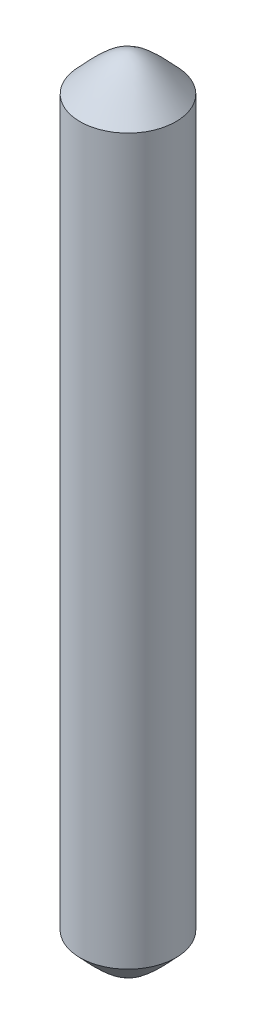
ISO-10303-21;
HEADER;
FILE_DESCRIPTION(('STEP AP214'),'2;1');
FILE_NAME('part.step','',(''),(''),'','','');
FILE_SCHEMA(('AUTOMOTIVE_DESIGN { 1 0 10303 214 1 1 1 1 }'));
ENDSEC;
DATA;
#1=APPLICATION_CONTEXT('core data for automotive mechanical design processes');
#2=APPLICATION_PROTOCOL_DEFINITION('international standard','automotive_design',2000,#1);
#3=PRODUCT_CONTEXT('',#1,'mechanical');
#4=PRODUCT('Part','Part','',(#3));
#5=PRODUCT_RELATED_PRODUCT_CATEGORY('part','',(#4));
#6=PRODUCT_DEFINITION_FORMATION('','',#4);
#7=PRODUCT_DEFINITION_CONTEXT('part definition',#1,'design');
#8=PRODUCT_DEFINITION('design','',#6,#7);
#9=PRODUCT_DEFINITION_SHAPE('','',#8);
#10=(LENGTH_UNIT() NAMED_UNIT(*) SI_UNIT(.MILLI.,.METRE.));
#11=(NAMED_UNIT(*) PLANE_ANGLE_UNIT() SI_UNIT($,.RADIAN.));
#12=(NAMED_UNIT(*) SI_UNIT($,.STERADIAN.) SOLID_ANGLE_UNIT());
#13=UNCERTAINTY_MEASURE_WITH_UNIT(LENGTH_MEASURE(1.E-05),#10,'distance_accuracy_value','');
#14=(GEOMETRIC_REPRESENTATION_CONTEXT(3) GLOBAL_UNCERTAINTY_ASSIGNED_CONTEXT((#13)) GLOBAL_UNIT_ASSIGNED_CONTEXT((#10,
#11,#12)) REPRESENTATION_CONTEXT('',''));
#15=CARTESIAN_POINT('',(0.,0.,0.));
#16=DIRECTION('',(0.,0.,1.));
#17=DIRECTION('',(1.,0.,0.));
#18=AXIS2_PLACEMENT_3D('',#15,#16,#17);
#19=CARTESIAN_POINT('',(0.,40.,0.));
#20=DIRECTION('',(0.,-1.,0.));
#21=DIRECTION('',(0.,0.,-1.));
#22=AXIS2_PLACEMENT_3D('',#19,#20,#21);
#23=CYLINDRICAL_SURFACE('',#22,2.65);
#24=CARTESIAN_POINT('',(2.68644969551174E-13,40.0000932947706,-2.65));
#25=CARTESIAN_POINT('',(-0.148851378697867,40.0000951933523,-2.64999339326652));
#26=CARTESIAN_POINT('',(-0.297810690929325,40.0001534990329,-2.63741634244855));
#27=CARTESIAN_POINT('',(-0.591626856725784,40.0001429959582,-2.5874186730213));
#28=CARTESIAN_POINT('',(-0.736478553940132,40.0000740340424,-2.54996815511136));
#29=CARTESIAN_POINT('',(-1.01778080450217,40.0000395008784,-2.45128909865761));
#30=CARTESIAN_POINT('',(-1.15423531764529,40.0000738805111,-2.39007186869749));
#31=CARTESIAN_POINT('',(-1.41489136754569,40.0001364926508,-2.24561449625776));
#32=CARTESIAN_POINT('',(-1.53909594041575,40.0001647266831,-2.16237982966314));
#33=CARTESIAN_POINT('',(-1.77178520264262,40.0001967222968,-1.97622694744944));
#34=CARTESIAN_POINT('',(-1.88026825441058,40.0002004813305,-1.87330668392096));
#35=CARTESIAN_POINT('',(-2.07841417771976,40.0001879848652,-1.65072983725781));
#36=CARTESIAN_POINT('',(-2.16807631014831,40.0001717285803,-1.53107259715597));
#37=CARTESIAN_POINT('',(-2.32605823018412,40.0001120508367,-1.27833209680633));
#38=CARTESIAN_POINT('',(-2.39437841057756,40.000068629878,-1.1452490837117));
#39=CARTESIAN_POINT('',(-2.47934118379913,40.0000585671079,-0.93858336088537));
#40=CARTESIAN_POINT('',(-2.50474989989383,40.0000644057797,-0.868488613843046));
#41=CARTESIAN_POINT('',(-2.54958212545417,40.0001046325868,-0.726418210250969));
#42=CARTESIAN_POINT('',(-2.56900563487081,40.0001390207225,-0.654442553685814));
#43=CARTESIAN_POINT('',(-2.61804549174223,40.0001872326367,-0.436418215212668));
#44=CARTESIAN_POINT('',(-2.63848198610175,40.0001462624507,-0.288148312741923));
#45=CARTESIAN_POINT('',(-2.65025715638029,40.0001179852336,-0.0649939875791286));
#46=CARTESIAN_POINT('',(-2.65103176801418,40.0001140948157,0.00954892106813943));
#47=CARTESIAN_POINT('',(-2.6463045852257,40.0001273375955,0.158461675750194));
#48=CARTESIAN_POINT('',(-2.64080279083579,40.0001444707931,0.232831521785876));
#49=CARTESIAN_POINT('',(-2.62354961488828,40.0001706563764,0.380840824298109));
#50=CARTESIAN_POINT('',(-2.61179823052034,40.0001797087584,0.454480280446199));
#51=CARTESIAN_POINT('',(-2.5821439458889,40.0001552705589,0.600491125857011));
#52=CARTESIAN_POINT('',(-2.56424104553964,40.0001217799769,0.672862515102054));
#53=CARTESIAN_POINT('',(-2.50146445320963,40.0000565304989,0.887303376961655));
#54=CARTESIAN_POINT('',(-2.4475072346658,40.0000598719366,1.02683260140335));
#55=CARTESIAN_POINT('',(-2.31695908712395,40.0001054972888,1.29477474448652));
#56=CARTESIAN_POINT('',(-2.24036817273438,40.0001477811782,1.4231876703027));
#57=CARTESIAN_POINT('',(-2.06670945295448,40.0001939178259,1.6653528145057));
#58=CARTESIAN_POINT('',(-1.9696416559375,40.0001977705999,1.7791050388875));
#59=CARTESIAN_POINT('',(-1.75778235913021,40.0001935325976,1.98869408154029));
#60=CARTESIAN_POINT('',(-1.64299083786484,40.0001854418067,2.08453087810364));
#61=CARTESIAN_POINT('',(-1.39896865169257,40.0001341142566,2.25557078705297));
#62=CARTESIAN_POINT('',(-1.26973798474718,40.0000908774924,2.33077389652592));
#63=CARTESIAN_POINT('',(-1.0004045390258,40.0000506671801,2.45842780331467));
#64=CARTESIAN_POINT('',(-0.860301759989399,40.0000536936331,2.51087860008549));
#65=CARTESIAN_POINT('',(-0.645197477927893,40.0001114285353,2.5713414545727));
#66=CARTESIAN_POINT('',(-0.572637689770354,40.0001395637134,2.58846373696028));
#67=CARTESIAN_POINT('',(-0.426314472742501,40.0001544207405,2.61654294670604));
#68=CARTESIAN_POINT('',(-0.352551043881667,40.0001411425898,2.62749987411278));
#69=CARTESIAN_POINT('',(-0.204368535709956,40.0001136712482,2.64315858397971));
#70=CARTESIAN_POINT('',(-0.129949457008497,40.0000994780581,2.64786037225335));
#71=CARTESIAN_POINT('',(0.0190215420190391,40.0000905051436,2.65097865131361));
#72=CARTESIAN_POINT('',(0.0935734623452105,40.0000957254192,2.64939514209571));
#73=CARTESIAN_POINT('',(0.24227885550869,40.0001197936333,2.63995294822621));
#74=CARTESIAN_POINT('',(0.316432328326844,40.0001386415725,2.63209426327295));
#75=CARTESIAN_POINT('',(0.463812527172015,40.00015041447,2.61015887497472));
#76=CARTESIAN_POINT('',(0.537039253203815,40.0001433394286,2.59608217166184));
#77=CARTESIAN_POINT('',(0.682051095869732,40.0001079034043,2.56180680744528));
#78=CARTESIAN_POINT('',(0.753836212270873,40.0000795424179,2.54160814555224));
#79=CARTESIAN_POINT('',(0.895432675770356,40.0000502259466,2.49524723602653));
#80=CARTESIAN_POINT('',(0.965244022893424,40.0000492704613,2.46908498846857));
#81=CARTESIAN_POINT('',(1.17097316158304,40.0000687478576,2.38190095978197));
#82=CARTESIAN_POINT('',(1.30331657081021,40.0001114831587,2.31215091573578));
#83=CARTESIAN_POINT('',(1.55434081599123,40.000169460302,2.15145684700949));
#84=CARTESIAN_POINT('',(1.67302165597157,40.0001847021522,2.06051282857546));
#85=CARTESIAN_POINT('',(1.89345056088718,40.0001999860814,1.85998151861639));
#86=CARTESIAN_POINT('',(1.99519861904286,40.0002000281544,1.75039421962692));
#87=CARTESIAN_POINT('',(2.17884722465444,40.0001675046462,1.51569538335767));
#88=CARTESIAN_POINT('',(2.26074775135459,40.0001349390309,1.39058382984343));
#89=CARTESIAN_POINT('',(2.40238325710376,40.0000761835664,1.12838603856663));
#90=CARTESIAN_POINT('',(2.46211825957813,40.0000499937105,0.991299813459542));
#91=CARTESIAN_POINT('',(2.5577252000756,40.0000952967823,0.709044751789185));
#92=CARTESIAN_POINT('',(2.59359715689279,40.000166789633,0.563875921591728));
#93=CARTESIAN_POINT('',(2.64046033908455,40.0001772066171,0.269576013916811));
#94=CARTESIAN_POINT('',(2.65145151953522,40.0001161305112,0.120444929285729));
#95=CARTESIAN_POINT('',(2.64824087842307,40.0001181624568,-0.177545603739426));
#96=CARTESIAN_POINT('',(2.63403908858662,40.0001812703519,-0.326405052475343));
#97=CARTESIAN_POINT('',(2.58084567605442,40.0001644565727,-0.619627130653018));
#98=CARTESIAN_POINT('',(2.54185400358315,40.0000845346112,-0.763989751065));
#99=CARTESIAN_POINT('',(2.44018676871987,40.0000449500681,-1.04412245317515));
#100=CARTESIAN_POINT('',(2.37751076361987,40.0000852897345,-1.17989237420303));
#101=CARTESIAN_POINT('',(2.23025671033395,40.0001510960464,-1.43897740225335));
#102=CARTESIAN_POINT('',(2.145679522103,40.0001765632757,-1.56229299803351));
#103=CARTESIAN_POINT('',(1.95703410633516,40.0002004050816,-1.79296271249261));
#104=CARTESIAN_POINT('',(1.85296792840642,40.0001987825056,-1.90031850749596));
#105=CARTESIAN_POINT('',(1.62825890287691,40.0001799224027,-2.09606232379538));
#106=CARTESIAN_POINT('',(1.50761194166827,40.0001626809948,-2.1844456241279));
#107=CARTESIAN_POINT('',(1.25314506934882,40.0000954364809,-2.33973615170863));
#108=CARTESIAN_POINT('',(1.11931889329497,40.0000454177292,-2.40663310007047));
#109=CARTESIAN_POINT('',(0.842439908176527,40.0000592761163,-2.51693293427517));
#110=CARTESIAN_POINT('',(0.699398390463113,40.0001230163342,-2.56036398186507));
#111=CARTESIAN_POINT('',(0.46287108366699,40.0001499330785,-2.61092412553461));
#112=CARTESIAN_POINT('',(0.370922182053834,40.0001418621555,-2.62555928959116));
#113=CARTESIAN_POINT('',(0.185996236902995,40.0001129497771,-2.64509929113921));
#114=CARTESIAN_POINT('',(0.0930191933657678,40.0000921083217,-2.65000412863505));
#115=CARTESIAN_POINT('',(2.68644969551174E-13,40.0000932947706,-2.65));
#116=B_SPLINE_CURVE_WITH_KNOTS('',3,(#24,#25,#26,#27,#28,#29,#30,#31,#32,#33,#34,#35,#36,#37,
#38,#39,#40,#41,#42,#43,#44,#45,#46,#47,#48,#49,#50,#51,#52,#53,#54,#55,#56,#57,#58,#59,#60,#61,
#62,#63,#64,#65,#66,#67,#68,#69,#70,#71,#72,#73,#74,#75,#76,#77,#78,#79,#80,#81,#82,#83,#84,#85,
#86,#87,#88,#89,#90,#91,#92,#93,#94,#95,#96,#97,#98,#99,#100,#101,#102,#103,#104,#105,#106,#107,
#108,#109,#110,#111,#112,#113,#114,#115),.UNSPECIFIED.,.T.,.F.,(4,2,2,2,2,2,2,2,2,2,2,2,2,2,2,2,
2,2,2,2,2,2,2,2,2,2,2,2,2,2,2,2,2,2,2,2,2,2,2,2,2,2,2,2,2,4),(0.,0.446214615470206,
0.892966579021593,1.33950623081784,1.78593492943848,2.23241009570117,2.67890279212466,
3.12538727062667,3.3488277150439,3.57226816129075,4.01875230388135,4.24219262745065,
4.46563294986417,4.6890733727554,4.91251379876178,5.35899780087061,5.80548151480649,
6.25196504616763,6.69844911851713,7.14493325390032,7.591417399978,7.81485812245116,
8.0382988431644,8.2617393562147,8.48517986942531,8.70862039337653,8.93206091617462,
9.15550147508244,9.37894203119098,9.82542577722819,10.2719093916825,10.7183931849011,
11.1648774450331,11.6113612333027,12.0578446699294,12.5043289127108,12.9508125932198,
13.3972971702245,13.8437900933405,14.2902654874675,14.7366939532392,15.1832333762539,
15.6299861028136,16.0762014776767,16.355046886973,16.6338922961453),.UNSPECIFIED.);
#117=CARTESIAN_POINT('',(2.68644969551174E-13,40.0000932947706,-2.65));
#118=VERTEX_POINT('',#117);
#119=EDGE_CURVE('E12',#118,#118,#116,.T.);
#120=ORIENTED_EDGE('',*,*,#119,.F.);
#121=EDGE_LOOP('',(#120));
#122=FACE_BOUND('',#121,.T.);
#123=CARTESIAN_POINT('',(5.26098378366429E-13,-9.32947705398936E-05,-2.65));
#124=CARTESIAN_POINT('',(-0.148851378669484,-9.51937966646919E-05,-2.64999339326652));
#125=CARTESIAN_POINT('',(-0.297810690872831,-0.000153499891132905,-2.63741634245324));
#126=CARTESIAN_POINT('',(-0.59162685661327,-0.000142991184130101,-2.58741867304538));
#127=CARTESIAN_POINT('',(-0.736478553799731,-7.40232144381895E-05,-2.54996815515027));
#128=CARTESIAN_POINT('',(-1.01778080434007,-3.94874680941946E-05,-2.45128909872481));
#129=CARTESIAN_POINT('',(-1.15423531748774,-7.38705677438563E-05,-2.39007186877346));
#130=CARTESIAN_POINT('',(-1.4148913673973,-0.00013649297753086,-2.24561449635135));
#131=CARTESIAN_POINT('',(-1.53909594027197,-0.000164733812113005,-2.16237982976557));
#132=CARTESIAN_POINT('',(-1.77178520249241,-0.000196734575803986,-1.9762269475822));
#133=CARTESIAN_POINT('',(-1.88026825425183,-0.000200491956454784,-1.87330668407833));
#134=CARTESIAN_POINT('',(-2.07841417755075,-0.000187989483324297,-1.65072983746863));
#135=CARTESIAN_POINT('',(-2.16807630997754,-0.000171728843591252,-1.53107259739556));
#136=CARTESIAN_POINT('',(-2.326058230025,-0.000112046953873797,-1.27833209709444));
#137=CARTESIAN_POINT('',(-2.39437841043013,-6.86262037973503E-05,-1.14524908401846));
#138=CARTESIAN_POINT('',(-2.47934118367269,-5.85640796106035E-05,-0.938583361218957));
#139=CARTESIAN_POINT('',(-2.50474989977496,-6.44030222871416E-05,-0.868488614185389));
#140=CARTESIAN_POINT('',(-2.54958212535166,-0.000104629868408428,-0.726418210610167));
#141=CARTESIAN_POINT('',(-2.56900563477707,-0.000139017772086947,-0.654442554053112));
#142=CARTESIAN_POINT('',(-2.61804549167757,-0.000187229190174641,-0.436418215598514));
#143=CARTESIAN_POINT('',(-2.63848198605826,-0.000146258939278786,-0.288148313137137));
#144=CARTESIAN_POINT('',(-2.65025715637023,-0.000117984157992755,-0.0649939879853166));
#145=CARTESIAN_POINT('',(-2.65103176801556,-0.000114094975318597,0.00954892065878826));
#146=CARTESIAN_POINT('',(-2.64630458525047,-0.000127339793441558,0.158461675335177));
#147=CARTESIAN_POINT('',(-2.64080279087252,-0.000144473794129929,0.232831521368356));
#148=CARTESIAN_POINT('',(-2.62354961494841,-0.000170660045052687,0.380840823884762));
#149=CARTESIAN_POINT('',(-2.61179823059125,-0.000179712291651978,0.454480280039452));
#150=CARTESIAN_POINT('',(-2.58214394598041,-0.000155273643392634,0.60049112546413));
#151=CARTESIAN_POINT('',(-2.56424104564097,-0.000121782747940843,0.672862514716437));
#152=CARTESIAN_POINT('',(-2.50146445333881,-5.65331764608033E-05,0.887303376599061));
#153=CARTESIAN_POINT('',(-2.44750723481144,-5.98756788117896E-05,1.02683260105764));
#154=CARTESIAN_POINT('',(-2.31695908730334,-0.000105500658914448,1.29477474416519));
#155=CARTESIAN_POINT('',(-2.24036817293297,-0.000147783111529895,1.42318766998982));
#156=CARTESIAN_POINT('',(-2.06670945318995,-0.000193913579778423,1.66535281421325));
#157=CARTESIAN_POINT('',(-1.9696416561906,-0.000197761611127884,1.779105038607));
#158=CARTESIAN_POINT('',(-1.75778235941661,-0.000193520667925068,1.98869408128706));
#159=CARTESIAN_POINT('',(-1.64299083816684,-0.000185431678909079,2.08453087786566));
#160=CARTESIAN_POINT('',(-1.39896865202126,-0.000134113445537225,2.2555707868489));
#161=CARTESIAN_POINT('',(-1.26973798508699,-9.0884196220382E-05,2.33077389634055));
#162=CARTESIAN_POINT('',(-1.00040453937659,-5.06805502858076E-05,2.45842780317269));
#163=CARTESIAN_POINT('',(-0.860301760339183,-5.37061547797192E-05,2.51087859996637));
#164=CARTESIAN_POINT('',(-0.645197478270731,-0.00011143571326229,2.57134145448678));
#165=CARTESIAN_POINT('',(-0.572637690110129,-0.000139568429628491,2.58846373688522));
#166=CARTESIAN_POINT('',(-0.426314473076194,-0.000154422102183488,2.61654294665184));
#167=CARTESIAN_POINT('',(-0.352551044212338,-0.000141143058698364,2.62749987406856));
#168=CARTESIAN_POINT('',(-0.20436853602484,-0.000113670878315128,2.64315858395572));
#169=CARTESIAN_POINT('',(-0.129949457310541,-9.94777422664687E-05,2.6478603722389));
#170=CARTESIAN_POINT('',(0.0190215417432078,-9.05051653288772E-05,2.65097865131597));
#171=CARTESIAN_POINT('',(0.0935734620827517,-9.57257244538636E-05,2.64939514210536));
#172=CARTESIAN_POINT('',(0.242278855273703,-0.000119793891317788,2.63995294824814));
#173=CARTESIAN_POINT('',(0.316432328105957,-0.000138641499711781,2.63209426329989));
#174=CARTESIAN_POINT('',(0.463812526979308,-0.000150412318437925,2.61015887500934));
#175=CARTESIAN_POINT('',(0.537039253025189,-0.000143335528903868,2.59608217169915));
#176=CARTESIAN_POINT('',(0.682051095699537,-0.000107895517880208,2.56180680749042));
#177=CARTESIAN_POINT('',(0.753836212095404,-7.95322929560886E-05,2.54160814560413));
#178=CARTESIAN_POINT('',(0.895432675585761,-5.02133050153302E-05,2.49524723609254));
#179=CARTESIAN_POINT('',(0.965244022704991,-4.92575416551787E-05,2.469084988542));
#180=CARTESIAN_POINT('',(1.17097316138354,-6.87376243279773E-05,2.3819009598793));
#181=CARTESIAN_POINT('',(1.30331657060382,-0.000111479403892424,2.31215091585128));
#182=CARTESIAN_POINT('',(1.55434081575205,-0.000169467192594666,2.15145684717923));
#183=CARTESIAN_POINT('',(1.67302165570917,-0.000184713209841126,2.06051282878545));
#184=CARTESIAN_POINT('',(1.89345056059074,-0.000199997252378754,1.85998151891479));
#185=CARTESIAN_POINT('',(1.99519861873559,-0.000200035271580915,1.75039421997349));
#186=CARTESIAN_POINT('',(2.17884722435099,-0.000167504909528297,1.51569538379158));
#187=CARTESIAN_POINT('',(2.26074775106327,-0.000134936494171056,1.39058383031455));
#188=CARTESIAN_POINT('',(2.40238325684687,-7.61794810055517E-05,1.12838603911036));
#189=CARTESIAN_POINT('',(2.46211825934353,-4.99908764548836E-05,0.991299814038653));
#190=CARTESIAN_POINT('',(2.55772519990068,-9.5294015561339E-05,0.709044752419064));
#191=CARTESIAN_POINT('',(2.59359715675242,-0.000166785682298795,0.563875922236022));
#192=CARTESIAN_POINT('',(2.64046033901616,-0.000177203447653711,0.269576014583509));
#193=CARTESIAN_POINT('',(2.65145151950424,-0.000116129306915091,0.120444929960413));
#194=CARTESIAN_POINT('',(2.64824087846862,-0.000118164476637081,-0.177545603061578));
#195=CARTESIAN_POINT('',(2.63403908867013,-0.000181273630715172,-0.326405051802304));
#196=CARTESIAN_POINT('',(2.58084567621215,-0.000164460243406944,-0.619627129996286));
#197=CARTESIAN_POINT('',(2.54185400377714,-8.45374148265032E-05,-0.763989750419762));
#198=CARTESIAN_POINT('',(2.44018676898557,-4.49531061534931E-05,-1.04412245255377));
#199=CARTESIAN_POINT('',(2.37751076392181,-8.52938741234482E-05,-1.17989237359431));
#200=CARTESIAN_POINT('',(2.23025671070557,-0.000151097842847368,-1.43897740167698));
#201=CARTESIAN_POINT('',(2.14567952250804,-0.000176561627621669,-1.56229299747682));
#202=CARTESIAN_POINT('',(1.95703410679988,-0.000200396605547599,-1.79296271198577));
#203=CARTESIAN_POINT('',(1.85296792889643,-0.000198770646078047,-1.90031850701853));
#204=CARTESIAN_POINT('',(1.62825890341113,-0.000179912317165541,-2.09606232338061));
#205=CARTESIAN_POINT('',(1.50761194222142,-0.000162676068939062,-2.1844456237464));
#206=CARTESIAN_POINT('',(1.25314506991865,-9.54426242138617E-05,-2.33973615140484));
#207=CARTESIAN_POINT('',(1.11931889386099,-4.5429782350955E-05,-2.40663309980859));
#208=CARTESIAN_POINT('',(0.842439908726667,-5.92889902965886E-05,-2.51693293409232));
#209=CARTESIAN_POINT('',(0.699398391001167,-0.000123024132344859,-2.56036398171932));
#210=CARTESIAN_POINT('',(0.462871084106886,-0.000149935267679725,-2.61092412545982));
#211=CARTESIAN_POINT('',(0.370922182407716,-0.000141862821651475,-2.62555928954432));
#212=CARTESIAN_POINT('',(0.185996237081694,-0.000112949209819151,-2.64509929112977));
#213=CARTESIAN_POINT('',(0.0930191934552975,-9.21080440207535E-05,-2.65000412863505));
#214=CARTESIAN_POINT('',(5.26098378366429E-13,-9.32947705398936E-05,-2.65));
#215=B_SPLINE_CURVE_WITH_KNOTS('',3,(#123,#124,#125,#126,#127,#128,#129,#130,#131,#132,#133,
#134,#135,#136,#137,#138,#139,#140,#141,#142,#143,#144,#145,#146,#147,#148,#149,#150,#151,#152,
#153,#154,#155,#156,#157,#158,#159,#160,#161,#162,#163,#164,#165,#166,#167,#168,#169,#170,#171,
#172,#173,#174,#175,#176,#177,#178,#179,#180,#181,#182,#183,#184,#185,#186,#187,#188,#189,#190,
#191,#192,#193,#194,#195,#196,#197,#198,#199,#200,#201,#202,#203,#204,#205,#206,#207,#208,#209,
#210,#211,#212,#213,#214),.UNSPECIFIED.,.T.,.F.,(4,2,2,2,2,2,2,2,2,2,2,2,2,2,2,2,2,2,2,2,2,2,2,
2,2,2,2,2,2,2,2,2,2,2,2,2,2,2,2,2,2,2,2,2,2,4),(0.,0.446214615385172,0.892966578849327,
1.33950623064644,1.78593492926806,2.2324100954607,2.67890279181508,3.12538727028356,
3.34882771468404,3.57226816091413,4.01875230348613,4.24219262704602,4.46563294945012,
4.68907337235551,4.91251379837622,5.35899780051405,5.80548151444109,6.25196504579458,
6.69844911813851,7.14493325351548,7.59141739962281,7.81485812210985,8.03829884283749,
8.26173935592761,8.48517986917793,8.70862039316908,8.93206091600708,9.15550147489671,
9.37894203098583,9.82542577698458,10.2719093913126,10.7183931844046,11.1648774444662,
11.6113612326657,12.0578446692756,12.5043289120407,12.9508125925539,13.3972971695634,
13.843790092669,14.2902654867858,14.7366939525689,15.1832333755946,15.6299861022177,
16.0762014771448,16.3550468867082,16.6338922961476),.UNSPECIFIED.);
#216=CARTESIAN_POINT('',(5.26098378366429E-13,-9.32947705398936E-05,-2.65));
#217=VERTEX_POINT('',#216);
#218=EDGE_CURVE('E96',#217,#217,#215,.T.);
#219=ORIENTED_EDGE('',*,*,#218,.T.);
#220=EDGE_LOOP('',(#219));
#221=FACE_BOUND('',#220,.T.);
#222=ADVANCED_FACE('F89',(#122,#221),#23,.T.);
#223=CARTESIAN_POINT('',(2.75805453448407,38.7959027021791,-2.74278233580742));
#224=CARTESIAN_POINT('',(2.75805453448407,39.0719045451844,-2.30393826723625));
#225=CARTESIAN_POINT('',(2.75805453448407,39.322524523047,-1.86509419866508));
#226=CARTESIAN_POINT('',(2.75805453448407,39.55582062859,-1.42625013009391));
#227=CARTESIAN_POINT('',(2.75805453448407,39.8204657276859,-0.76798310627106));
#228=CARTESIAN_POINT('',(2.75805453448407,39.8932726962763,-0.109716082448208));
#229=CARTESIAN_POINT('',(2.75805453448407,39.8932731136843,0.109706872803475));
#230=CARTESIAN_POINT('',(2.75805453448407,39.8204683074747,0.767975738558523));
#231=CARTESIAN_POINT('',(2.75805453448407,39.555823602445,1.42624460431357));
#232=CARTESIAN_POINT('',(2.75805453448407,39.3225265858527,1.86509051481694));
#233=CARTESIAN_POINT('',(2.75805453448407,39.0719056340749,2.3039364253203));
#234=CARTESIAN_POINT('',(2.75805453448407,38.7959026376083,2.74278233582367));
#235=CARTESIAN_POINT('',(2.31676692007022,39.0759932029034,-2.74278233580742));
#236=CARTESIAN_POINT('',(2.31676692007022,39.3972921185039,-2.30393826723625));
#237=CARTESIAN_POINT('',(2.31676692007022,39.6927650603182,-1.86509419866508));
#238=CARTESIAN_POINT('',(2.31676692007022,39.9731712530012,-1.42625013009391));
#239=CARTESIAN_POINT('',(2.31676692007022,40.2945559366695,-0.76798310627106));
#240=CARTESIAN_POINT('',(2.31676692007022,40.3832445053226,-0.109716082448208));
#241=CARTESIAN_POINT('',(2.31676692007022,40.3832450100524,0.109706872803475));
#242=CARTESIAN_POINT('',(2.31676692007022,40.2945590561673,0.767975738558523));
#243=CARTESIAN_POINT('',(2.31676692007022,39.9731748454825,1.42624460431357));
#244=CARTESIAN_POINT('',(2.31676692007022,39.6927674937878,1.86509051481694));
#245=CARTESIAN_POINT('',(2.31676692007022,39.3972934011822,2.3039364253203));
#246=CARTESIAN_POINT('',(2.31676692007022,39.0759931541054,2.74278233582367));
#247=CARTESIAN_POINT('',(1.87547930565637,39.3303966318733,-2.74278233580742));
#248=CARTESIAN_POINT('',(1.87547930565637,39.6965319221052,-2.30393826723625));
#249=CARTESIAN_POINT('',(1.87547930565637,40.0361481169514,-1.86509419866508));
#250=CARTESIAN_POINT('',(1.87547930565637,40.3648101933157,-1.42625013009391));
#251=CARTESIAN_POINT('',(1.87547930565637,40.7449396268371,-0.76798310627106));
#252=CARTESIAN_POINT('',(1.87547930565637,40.8500841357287,-0.109716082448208));
#253=CARTESIAN_POINT('',(1.87547930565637,40.8500847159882,0.109706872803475));
#254=CARTESIAN_POINT('',(1.87547930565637,40.7449433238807,0.767975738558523));
#255=CARTESIAN_POINT('',(1.87547930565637,40.3648144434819,1.42624460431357));
#256=CARTESIAN_POINT('',(1.87547930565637,40.0361508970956,1.86509051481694));
#257=CARTESIAN_POINT('',(1.87547930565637,39.6965333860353,2.3039364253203));
#258=CARTESIAN_POINT('',(1.87547930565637,39.3303966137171,2.74278233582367));
#259=CARTESIAN_POINT('',(1.43419169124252,39.5674585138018,-2.74278233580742));
#260=CARTESIAN_POINT('',(1.43419169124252,39.9806261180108,-2.30393826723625));
#261=CARTESIAN_POINT('',(1.43419169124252,40.3683845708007,-1.86509419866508));
#262=CARTESIAN_POINT('',(1.43419169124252,40.7490641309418,-1.42625013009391));
#263=CARTESIAN_POINT('',(1.43419169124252,41.1835407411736,-0.76798310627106));
#264=CARTESIAN_POINT('',(1.43419169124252,41.305477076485,-0.109716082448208));
#265=CARTESIAN_POINT('',(1.43419169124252,41.3054777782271,0.109706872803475));
#266=CARTESIAN_POINT('',(1.43419169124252,41.1835449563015,0.767975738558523));
#267=CARTESIAN_POINT('',(1.43419169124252,40.7490690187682,1.42624460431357));
#268=CARTESIAN_POINT('',(1.43419169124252,40.3683877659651,1.86509051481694));
#269=CARTESIAN_POINT('',(1.43419169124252,39.9806278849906,2.3039364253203));
#270=CARTESIAN_POINT('',(1.43419169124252,39.5674585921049,2.74278233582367));
#271=CARTESIAN_POINT('',(0.772259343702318,39.8364220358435,-2.74278233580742));
#272=CARTESIAN_POINT('',(0.772259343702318,40.3063077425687,-2.30393826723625));
#273=CARTESIAN_POINT('',(0.772259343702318,40.7527557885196,-1.86509419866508));
#274=CARTESIAN_POINT('',(0.772259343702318,41.1875634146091,-1.42625013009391));
#275=CARTESIAN_POINT('',(0.772259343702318,41.7250254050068,-0.76798310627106));
#276=CARTESIAN_POINT('',(0.772259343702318,41.8783764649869,-0.109716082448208));
#277=CARTESIAN_POINT('',(0.772259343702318,41.8783773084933,0.109706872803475));
#278=CARTESIAN_POINT('',(0.772259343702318,41.7250308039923,0.767975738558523));
#279=CARTESIAN_POINT('',(0.772259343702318,41.1875690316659,1.42624460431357));
#280=CARTESIAN_POINT('',(0.772259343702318,40.7527595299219,1.86509051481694));
#281=CARTESIAN_POINT('',(0.772259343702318,40.3063097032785,2.3039364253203));
#282=CARTESIAN_POINT('',(0.772259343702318,39.8364220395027,2.74278233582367));
#283=CARTESIAN_POINT('',(0.110326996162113,39.9105135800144,-2.74278233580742));
#284=CARTESIAN_POINT('',(0.110326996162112,40.3962113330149,-2.30393826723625));
#285=CARTESIAN_POINT('',(0.110326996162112,40.8590238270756,-1.86509419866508));
#286=CARTESIAN_POINT('',(0.110326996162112,41.3106172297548,-1.42625013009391));
#287=CARTESIAN_POINT('',(0.110326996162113,41.8794619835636,-0.76798310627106));
#288=CARTESIAN_POINT('',(0.110326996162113,42.0560321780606,-0.109716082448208));
#289=CARTESIAN_POINT('',(0.110326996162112,42.0560332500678,0.109706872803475));
#290=CARTESIAN_POINT('',(0.110326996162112,41.8794678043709,0.767975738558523));
#291=CARTESIAN_POINT('',(0.110326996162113,41.3106230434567,1.42624460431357));
#292=CARTESIAN_POINT('',(0.110326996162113,40.8590276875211,1.86509051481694));
#293=CARTESIAN_POINT('',(0.110326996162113,40.3962133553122,2.3039364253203));
#294=CARTESIAN_POINT('',(0.110326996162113,39.9105135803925,2.74278233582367));
#295=CARTESIAN_POINT('',(-0.110317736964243,39.9105139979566,-2.74278233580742));
#296=CARTESIAN_POINT('',(-0.110317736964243,40.3962118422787,-2.30393826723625));
#297=CARTESIAN_POINT('',(-0.110317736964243,40.8590244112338,-1.86509419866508));
#298=CARTESIAN_POINT('',(-0.110317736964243,41.3106179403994,-1.42625013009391));
#299=CARTESIAN_POINT('',(-0.110317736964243,41.8794628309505,-0.76798310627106));
#300=CARTESIAN_POINT('',(-0.110317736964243,42.0560332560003,-0.109716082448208));
#301=CARTESIAN_POINT('',(-0.110317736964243,42.056034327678,0.109706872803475));
#302=CARTESIAN_POINT('',(-0.110317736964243,41.8794686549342,0.767975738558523));
#303=CARTESIAN_POINT('',(-0.110317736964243,41.3106237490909,1.42624460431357));
#304=CARTESIAN_POINT('',(-0.110317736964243,40.859028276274,1.86509051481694));
#305=CARTESIAN_POINT('',(-0.110317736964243,40.3962138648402,2.3039364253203));
#306=CARTESIAN_POINT('',(-0.110317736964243,39.9105140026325,2.74278233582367));
#307=CARTESIAN_POINT('',(-0.77225193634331,39.8364246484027,-2.74278233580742));
#308=CARTESIAN_POINT('',(-0.77225193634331,40.3063109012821,-2.30393826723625));
#309=CARTESIAN_POINT('',(-0.77225193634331,40.752759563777,-1.86509419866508));
#310=CARTESIAN_POINT('',(-0.77225193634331,41.187567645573,-1.42625013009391));
#311=CARTESIAN_POINT('',(-0.77225193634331,41.7250308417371,-0.76798310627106));
#312=CARTESIAN_POINT('',(-0.77225193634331,41.8783823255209,-0.109716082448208));
#313=CARTESIAN_POINT('',(-0.77225193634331,41.8783831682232,0.109706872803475));
#314=CARTESIAN_POINT('',(-0.77225193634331,41.7250362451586,0.767975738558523));
#315=CARTESIAN_POINT('',(-0.77225193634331,41.1875732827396,1.42624460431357));
#316=CARTESIAN_POINT('',(-0.77225193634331,40.7527632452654,1.86509051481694));
#317=CARTESIAN_POINT('',(-0.77225193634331,40.3063128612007,2.3039364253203));
#318=CARTESIAN_POINT('',(-0.77225193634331,39.8364246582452,2.74278233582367));
#319=CARTESIAN_POINT('',(-1.43418613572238,39.5674615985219,-2.74278233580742));
#320=CARTESIAN_POINT('',(-1.43418613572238,39.9806297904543,-2.30393826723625));
#321=CARTESIAN_POINT('',(-1.43418613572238,40.3683887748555,-1.86509419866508));
#322=CARTESIAN_POINT('',(-1.43418613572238,40.7490690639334,-1.42625013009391));
#323=CARTESIAN_POINT('',(-1.43418613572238,41.1835464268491,-0.76798310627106));
#324=CARTESIAN_POINT('',(-1.43418613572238,41.3054829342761,-0.109716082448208));
#325=CARTESIAN_POINT('',(-1.43418613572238,41.3054836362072,0.109706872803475));
#326=CARTESIAN_POINT('',(-1.43418613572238,41.18355061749,0.767975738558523));
#327=CARTESIAN_POINT('',(-1.43418613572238,40.7490739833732,1.42624460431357));
#328=CARTESIAN_POINT('',(-1.43418613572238,40.3683920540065,1.86509051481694));
#329=CARTESIAN_POINT('',(-1.43418613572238,39.9806314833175,2.3039364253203));
#330=CARTESIAN_POINT('',(-1.43418613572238,39.5674615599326,2.74278233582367));
#331=CARTESIAN_POINT('',(-1.87547560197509,39.3303986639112,-2.74278233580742));
#332=CARTESIAN_POINT('',(-1.87547560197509,39.6965343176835,-2.30393826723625));
#333=CARTESIAN_POINT('',(-1.87547560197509,40.0361509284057,-1.86509419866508));
#334=CARTESIAN_POINT('',(-1.87547560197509,40.3648135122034,-1.42625013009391));
#335=CARTESIAN_POINT('',(-1.87547560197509,40.7449433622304,-0.76798310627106));
#336=CARTESIAN_POINT('',(-1.87547560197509,40.8500880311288,-0.109716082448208));
#337=CARTESIAN_POINT('',(-1.87547560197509,40.8500886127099,0.109706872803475));
#338=CARTESIAN_POINT('',(-1.87547560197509,40.7449470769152,0.767975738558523));
#339=CARTESIAN_POINT('',(-1.87547560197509,40.364817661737,1.42624460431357));
#340=CARTESIAN_POINT('',(-1.87547560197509,40.0361538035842,1.86509051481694));
#341=CARTESIAN_POINT('',(-1.87547560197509,39.6965358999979,2.3039364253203));
#342=CARTESIAN_POINT('',(-1.87547560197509,39.3303987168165,2.74278233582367));
#343=CARTESIAN_POINT('',(-2.3167650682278,39.0759942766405,-2.74278233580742));
#344=CARTESIAN_POINT('',(-2.3167650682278,39.3972934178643,-2.30393826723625));
#345=CARTESIAN_POINT('',(-2.3167650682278,39.6927666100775,-1.86509419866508));
#346=CARTESIAN_POINT('',(-2.3167650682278,39.9731730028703,-1.42625013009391));
#347=CARTESIAN_POINT('',(-2.3167650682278,40.2945579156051,-0.76798310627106));
#348=CARTESIAN_POINT('',(-2.3167650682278,40.3832465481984,-0.109716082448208));
#349=CARTESIAN_POINT('',(-2.3167650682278,40.3832470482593,0.109706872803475));
#350=CARTESIAN_POINT('',(-2.3167650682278,40.2945610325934,0.767975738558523));
#351=CARTESIAN_POINT('',(-2.3167650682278,39.9731765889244,1.42624460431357));
#352=CARTESIAN_POINT('',(-2.3167650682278,39.6927690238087,1.86509051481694));
#353=CARTESIAN_POINT('',(-2.3167650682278,39.3972947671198,2.3039364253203));
#354=CARTESIAN_POINT('',(-2.3167650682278,39.0759943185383,2.74278233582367));
#355=CARTESIAN_POINT('',(-2.75805453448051,38.7959026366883,-2.74278233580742));
#356=CARTESIAN_POINT('',(-2.75805453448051,39.071904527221,-2.30393826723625));
#357=CARTESIAN_POINT('',(-2.75805453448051,39.3225245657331,-1.86509419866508));
#358=CARTESIAN_POINT('',(-2.75805453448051,39.5558206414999,-1.42625013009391));
#359=CARTESIAN_POINT('',(-2.75805453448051,39.8204657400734,-0.76798310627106));
#360=CARTESIAN_POINT('',(-2.75805453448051,39.8932727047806,-0.109716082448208));
#361=CARTESIAN_POINT('',(-2.75805453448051,39.8932731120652,0.109706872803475));
#362=CARTESIAN_POINT('',(-2.75805453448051,39.8204683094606,0.767975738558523));
#363=CARTESIAN_POINT('',(-2.75805453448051,39.5558236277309,1.42624460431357));
#364=CARTESIAN_POINT('',(-2.75805453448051,39.3225265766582,1.86509051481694));
#365=CARTESIAN_POINT('',(-2.75805453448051,39.0719056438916,2.3039364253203));
#366=CARTESIAN_POINT('',(-2.75805453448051,38.7959026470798,2.74278233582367));
#367=B_SPLINE_SURFACE_WITH_KNOTS('',5,5,((#223,#224,#225,#226,#227,#228,#229,#230,#231,#232,
#233,#234),(#235,#236,#237,#238,#239,#240,#241,#242,#243,#244,#245,#246),(#247,#248,#249,#250,
#251,#252,#253,#254,#255,#256,#257,#258),(#259,#260,#261,#262,#263,#264,#265,#266,#267,#268,
#269,#270),(#271,#272,#273,#274,#275,#276,#277,#278,#279,#280,#281,#282),(#283,#284,#285,#286,
#287,#288,#289,#290,#291,#292,#293,#294),(#295,#296,#297,#298,#299,#300,#301,#302,#303,#304,
#305,#306),(#307,#308,#309,#310,#311,#312,#313,#314,#315,#316,#317,#318),(#319,#320,#321,#322,
#323,#324,#325,#326,#327,#328,#329,#330),(#331,#332,#333,#334,#335,#336,#337,#338,#339,#340,
#341,#342),(#343,#344,#345,#346,#347,#348,#349,#350,#351,#352,#353,#354),(#355,#356,#357,#358,
#359,#360,#361,#362,#363,#364,#365,#366)),.UNSPECIFIED.,.F.,.F.,.F.,(6,3,3,6),(6,3,3,6),
(-2.75805453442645,-0.551616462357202,0.551607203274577,2.75805453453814),(-2.74278233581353,
-0.548561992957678,0.548552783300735,2.74278233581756),.UNSPECIFIED.);
#368=ORIENTED_EDGE('',*,*,#119,.T.);
#369=EDGE_LOOP('',(#368));
#370=FACE_BOUND('',#369,.T.);
#371=ADVANCED_FACE('F109',(#370),#367,.T.);
#372=CARTESIAN_POINT('',(2.75805453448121,1.20409733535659,-2.74278233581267));
#373=CARTESIAN_POINT('',(2.75805453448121,0.928095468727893,-2.30393826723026));
#374=CARTESIAN_POINT('',(2.75805453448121,0.677475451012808,-1.86509419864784));
#375=CARTESIAN_POINT('',(2.75805453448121,0.44417937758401,-1.42625013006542));
#376=CARTESIAN_POINT('',(2.75805453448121,0.179534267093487,-0.767983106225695));
#377=CARTESIAN_POINT('',(2.75805453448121,0.10672729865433,-0.109716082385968));
#378=CARTESIAN_POINT('',(2.75805453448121,0.106726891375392,0.109706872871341));
#379=CARTESIAN_POINT('',(2.75805453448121,0.179531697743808,0.767975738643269));
#380=CARTESIAN_POINT('',(2.75805453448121,0.44417639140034,1.4262446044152));
#381=CARTESIAN_POINT('',(2.75805453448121,0.677473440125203,1.86509051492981));
#382=CARTESIAN_POINT('',(2.75805453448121,0.928094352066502,2.30393642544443));
#383=CARTESIAN_POINT('',(2.75805453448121,1.20409732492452,2.74278233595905));
#384=CARTESIAN_POINT('',(2.31676692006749,0.924006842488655,-2.74278233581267));
#385=CARTESIAN_POINT('',(2.31676692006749,0.60270791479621,-2.30393826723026));
#386=CARTESIAN_POINT('',(2.31676692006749,0.307234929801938,-1.86509419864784));
#387=CARTESIAN_POINT('',(2.31676692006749,0.026828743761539,-1.42625013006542));
#388=CARTESIAN_POINT('',(2.31676692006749,-0.294555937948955,-0.767983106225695));
#389=CARTESIAN_POINT('',(2.31676692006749,-0.383244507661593,-0.109716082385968));
#390=CARTESIAN_POINT('',(2.31676692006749,-0.383245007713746,0.109706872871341));
#391=CARTESIAN_POINT('',(2.31676692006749,-0.294559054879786,0.767975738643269));
#392=CARTESIAN_POINT('',(2.31676692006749,0.0268251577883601,1.4262446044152));
#393=CARTESIAN_POINT('',(2.31676692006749,0.30723251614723,1.86509051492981));
#394=CARTESIAN_POINT('',(2.31676692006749,0.602706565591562,2.30393642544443));
#395=CARTESIAN_POINT('',(2.31676692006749,0.924006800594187,2.74278233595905));
#396=CARTESIAN_POINT('',(1.87547930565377,0.669603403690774,-2.74278233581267));
#397=CARTESIAN_POINT('',(1.87547930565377,0.303468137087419,-2.30393826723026));
#398=CARTESIAN_POINT('',(1.87547930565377,-0.0361480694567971,-1.86509419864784));
#399=CARTESIAN_POINT('',(1.87547930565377,-0.364810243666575,-1.42625013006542));
#400=CARTESIAN_POINT('',(1.87547930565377,-0.744939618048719,-0.767983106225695));
#401=CARTESIAN_POINT('',(1.87547930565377,-0.850084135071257,-0.109716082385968));
#402=CARTESIAN_POINT('',(1.87547930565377,-0.850084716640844,0.109706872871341));
#403=CARTESIAN_POINT('',(1.87547930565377,-0.7449433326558,0.767975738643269));
#404=CARTESIAN_POINT('',(1.87547930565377,-0.364814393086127,1.4262446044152));
#405=CARTESIAN_POINT('',(1.87547930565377,-0.0361509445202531,1.86509051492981));
#406=CARTESIAN_POINT('',(1.87547930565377,0.303466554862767,2.30393642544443));
#407=CARTESIAN_POINT('',(1.87547930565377,0.669603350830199,2.74278233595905));
#408=CARTESIAN_POINT('',(1.43419169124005,0.432541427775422,-2.74278233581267));
#409=CARTESIAN_POINT('',(1.43419169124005,0.0193738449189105,-2.30393826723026));
#410=CARTESIAN_POINT('',(1.43419169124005,-0.368384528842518,-1.86509419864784));
#411=CARTESIAN_POINT('',(1.43419169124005,-0.749064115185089,-1.42625013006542));
#412=CARTESIAN_POINT('',(1.43419169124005,-1.18354075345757,-0.767983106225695));
#413=CARTESIAN_POINT('',(1.43419169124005,-1.30547707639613,-0.109716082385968));
#414=CARTESIAN_POINT('',(1.43419169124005,-1.30547777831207,0.109706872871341));
#415=CARTESIAN_POINT('',(1.43419169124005,-1.18354494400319,0.767975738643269));
#416=CARTESIAN_POINT('',(1.43419169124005,-0.749069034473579,1.4262446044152));
#417=CARTESIAN_POINT('',(1.43419169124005,-0.368387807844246,1.86509051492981));
#418=CARTESIAN_POINT('',(1.43419169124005,0.0193721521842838,2.30393642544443));
#419=CARTESIAN_POINT('',(1.43419169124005,0.43254146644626,2.74278233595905));
#420=CARTESIAN_POINT('',(0.772259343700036,0.163577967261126,-2.74278233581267));
#421=CARTESIAN_POINT('',(0.772259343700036,-0.306307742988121,-2.30393826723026));
#422=CARTESIAN_POINT('',(0.772259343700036,-0.752755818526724,-1.86509419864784));
#423=CARTESIAN_POINT('',(0.772259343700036,-1.18756340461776,-1.42625013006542));
#424=CARTESIAN_POINT('',(0.772259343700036,-1.7250254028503,-0.767983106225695));
#425=CARTESIAN_POINT('',(0.772259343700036,-1.87837646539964,-0.109716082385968));
#426=CARTESIAN_POINT('',(0.772259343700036,-1.87837730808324,0.109706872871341));
#427=CARTESIAN_POINT('',(0.772259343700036,-1.72503080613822,0.767975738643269));
#428=CARTESIAN_POINT('',(0.772259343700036,-1.18756904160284,1.4262446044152));
#429=CARTESIAN_POINT('',(0.772259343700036,-0.752759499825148,1.86509051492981));
#430=CARTESIAN_POINT('',(0.772259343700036,-0.30630970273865,2.30393642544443));
#431=CARTESIAN_POINT('',(0.772259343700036,0.16357795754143,2.74278233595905));
#432=CARTESIAN_POINT('',(0.110326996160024,0.0894864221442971,-2.74278233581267));
#433=CARTESIAN_POINT('',(0.110326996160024,-0.396211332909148,-2.30393826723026));
#434=CARTESIAN_POINT('',(0.110326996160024,-0.859023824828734,-1.86509419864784));
#435=CARTESIAN_POINT('',(0.110326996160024,-1.31061723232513,-1.42625013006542));
#436=CARTESIAN_POINT('',(0.110326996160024,-1.87946198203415,-0.767983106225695));
#437=CARTESIAN_POINT('',(0.110326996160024,-2.05603217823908,-0.109716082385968));
#438=CARTESIAN_POINT('',(0.110326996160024,-2.05603324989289,0.109706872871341));
#439=CARTESIAN_POINT('',(0.110326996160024,-1.87946780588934,0.767975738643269));
#440=CARTESIAN_POINT('',(0.110326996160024,-1.31062304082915,1.4262446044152));
#441=CARTESIAN_POINT('',(0.110326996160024,-0.859027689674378,1.86509051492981));
#442=CARTESIAN_POINT('',(0.110326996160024,-0.396213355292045,2.30393642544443));
#443=CARTESIAN_POINT('',(0.110326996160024,0.0894864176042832,2.74278233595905));
#444=CARTESIAN_POINT('',(-0.110317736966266,0.0894859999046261,-2.74278233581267));
#445=CARTESIAN_POINT('',(-0.110317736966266,-0.396211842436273,-2.30393826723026));
#446=CARTESIAN_POINT('',(-0.110317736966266,-0.859024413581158,-1.86509419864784));
#447=CARTESIAN_POINT('',(-0.110317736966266,-1.31061793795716,-1.42625013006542));
#448=CARTESIAN_POINT('',(-0.110317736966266,-1.87946283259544,-0.767983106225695));
#449=CARTESIAN_POINT('',(-0.110317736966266,-2.05603325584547,-0.109716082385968));
#450=CARTESIAN_POINT('',(-0.110317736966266,-2.05603432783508,0.109706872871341));
#451=CARTESIAN_POINT('',(-0.110317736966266,-1.87946865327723,0.767975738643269));
#452=CARTESIAN_POINT('',(-0.110317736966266,-1.31062375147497,1.4262446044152));
#453=CARTESIAN_POINT('',(-0.110317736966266,-0.859028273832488,1.86509051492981));
#454=CARTESIAN_POINT('',(-0.110317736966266,-0.396213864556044,2.30393642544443));
#455=CARTESIAN_POINT('',(-0.110317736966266,0.0894859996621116,2.74278233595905));
#456=CARTESIAN_POINT('',(-0.772251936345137,0.163575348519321,-2.74278233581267));
#457=CARTESIAN_POINT('',(-0.772251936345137,-0.306310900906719,-2.30393826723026));
#458=CARTESIAN_POINT('',(-0.772251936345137,-0.752759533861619,-1.86509419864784));
#459=CARTESIAN_POINT('',(-0.772251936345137,-1.18756765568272,-1.42625013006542));
#460=CARTESIAN_POINT('',(-0.772251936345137,-1.7250308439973,-0.767983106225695));
#461=CARTESIAN_POINT('',(-0.772251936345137,-1.87838232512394,-0.109716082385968));
#462=CARTESIAN_POINT('',(-0.772251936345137,-1.87838316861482,0.109706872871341));
#463=CARTESIAN_POINT('',(-0.772251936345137,-1.72503624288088,0.767975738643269));
#464=CARTESIAN_POINT('',(-0.772251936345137,-1.18757327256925,1.4262446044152));
#465=CARTESIAN_POINT('',(-0.772251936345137,-0.752763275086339,1.86509051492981));
#466=CARTESIAN_POINT('',(-0.772251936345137,-0.306312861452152,2.30393642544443));
#467=CARTESIAN_POINT('',(-0.772251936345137,0.163575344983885,2.74278233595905));
#468=CARTESIAN_POINT('',(-1.43418613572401,0.432538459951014,-2.74278233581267));
#469=CARTESIAN_POINT('',(-1.43418613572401,0.0193702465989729,-2.30393826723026));
#470=CARTESIAN_POINT('',(-1.43418613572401,-0.368388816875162,-1.86509419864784));
#471=CARTESIAN_POINT('',(-1.43418613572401,-0.749069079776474,-1.42625013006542));
#472=CARTESIAN_POINT('',(-1.43418613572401,-1.18354641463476,-0.767983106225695));
#473=CARTESIAN_POINT('',(-1.43418613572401,-1.30548293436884,-0.109716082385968));
#474=CARTESIAN_POINT('',(-1.43418613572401,-1.3054836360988,0.109706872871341));
#475=CARTESIAN_POINT('',(-1.43418613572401,-1.18355062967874,0.767975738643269));
#476=CARTESIAN_POINT('',(-1.43418613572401,-0.749073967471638,1.4262446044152));
#477=CARTESIAN_POINT('',(-1.43418613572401,-0.368392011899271,1.86509051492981));
#478=CARTESIAN_POINT('',(-1.43418613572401,0.0193684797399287,2.30393642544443));
#479=CARTESIAN_POINT('',(-1.43418613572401,0.432538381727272,2.74278233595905));
#480=CARTESIAN_POINT('',(-1.87547560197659,0.66960130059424,-2.74278233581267));
#481=CARTESIAN_POINT('',(-1.87547560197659,0.303465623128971,-2.30393826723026));
#482=CARTESIAN_POINT('',(-1.87547560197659,-0.0361509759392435,-1.86509419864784));
#483=CARTESIAN_POINT('',(-1.87547560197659,-0.364813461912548,-1.42625013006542));
#484=CARTESIAN_POINT('',(-1.87547560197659,-0.744943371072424,-0.767983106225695));
#485=CARTESIAN_POINT('',(-1.87547560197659,-0.85008803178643,-0.109716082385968));
#486=CARTESIAN_POINT('',(-1.87547560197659,-0.850088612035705,0.109706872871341));
#487=CARTESIAN_POINT('',(-1.87547560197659,-0.744947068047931,0.767975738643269));
#488=CARTESIAN_POINT('',(-1.87547560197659,-0.364817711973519,1.4262446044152));
#489=CARTESIAN_POINT('',(-1.87547560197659,-0.036153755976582,1.86509051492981));
#490=CARTESIAN_POINT('',(-1.87547560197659,0.303464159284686,2.30393642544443));
#491=CARTESIAN_POINT('',(-1.87547560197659,0.669601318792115,2.74278233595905));
#492=CARTESIAN_POINT('',(-2.31676506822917,0.924005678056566,-2.74278233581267));
#493=CARTESIAN_POINT('',(-2.31676506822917,0.602706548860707,-2.30393826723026));
#494=CARTESIAN_POINT('',(-2.31676506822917,0.307233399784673,-1.86509419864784));
#495=CARTESIAN_POINT('',(-2.31676506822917,0.0268270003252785,-1.42625013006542));
#496=CARTESIAN_POINT('',(-2.31676506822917,-0.294557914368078,-0.767983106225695));
#497=CARTESIAN_POINT('',(-2.31676506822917,-0.383246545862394,-0.109716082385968));
#498=CARTESIAN_POINT('',(-2.31676506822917,-0.383247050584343,0.109706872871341));
#499=CARTESIAN_POINT('',(-2.31676506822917,-0.294561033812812,0.767975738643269));
#500=CARTESIAN_POINT('',(-2.31676506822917,0.0268234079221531,1.4262446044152));
#501=CARTESIAN_POINT('',(-2.31676506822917,0.307230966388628,1.86509051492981));
#502=CARTESIAN_POINT('',(-2.31676506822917,0.602705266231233,2.30393642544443));
#503=CARTESIAN_POINT('',(-2.31676506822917,0.924005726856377,2.74278233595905));
#504=CARTESIAN_POINT('',(-2.75805453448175,1.20409732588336,-2.74278233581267));
#505=CARTESIAN_POINT('',(-2.75805453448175,0.92809545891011,-2.30393826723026));
#506=CARTESIAN_POINT('',(-2.75805453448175,0.677475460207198,-1.86509419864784));
#507=CARTESIAN_POINT('',(-2.75805453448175,0.444179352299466,-1.42625013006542));
#508=CARTESIAN_POINT('',(-2.75805453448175,0.17953426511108,-0.767983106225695));
#509=CARTESIAN_POINT('',(-2.75805453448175,0.10672730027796,-0.109716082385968));
#510=CARTESIAN_POINT('',(-2.75805453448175,0.106726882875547,0.109706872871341));
#511=CARTESIAN_POINT('',(-2.75805453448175,0.179531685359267,0.767975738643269));
#512=CARTESIAN_POINT('',(-2.75805453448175,0.444176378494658,1.4262446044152));
#513=CARTESIAN_POINT('',(-2.75805453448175,0.677473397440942,1.86509051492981));
#514=CARTESIAN_POINT('',(-2.75805453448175,0.92809437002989,2.30393642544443));
#515=CARTESIAN_POINT('',(-2.75805453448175,1.2040973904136,2.74278233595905));
#516=B_SPLINE_SURFACE_WITH_KNOTS('',5,5,((#372,#373,#374,#375,#376,#377,#378,#379,#380,#381,
#382,#383),(#384,#385,#386,#387,#388,#389,#390,#391,#392,#393,#394,#395),(#396,#397,#398,#399,
#400,#401,#402,#403,#404,#405,#406,#407),(#408,#409,#410,#411,#412,#413,#414,#415,#416,#417,
#418,#419),(#420,#421,#422,#423,#424,#425,#426,#427,#428,#429,#430,#431),(#432,#433,#434,#435,
#436,#437,#438,#439,#440,#441,#442,#443),(#444,#445,#446,#447,#448,#449,#450,#451,#452,#453,
#454,#455),(#456,#457,#458,#459,#460,#461,#462,#463,#464,#465,#466,#467),(#468,#469,#470,#471,
#472,#473,#474,#475,#476,#477,#478,#479),(#480,#481,#482,#483,#484,#485,#486,#487,#488,#489,
#490,#491),(#492,#493,#494,#495,#496,#497,#498,#499,#500,#501,#502,#503),(#504,#505,#506,#507,
#508,#509,#510,#511,#512,#513,#514,#515)),.UNSPECIFIED.,.F.,.F.,.F.,(6,3,3,6),(6,3,3,6),
(-2.75805453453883,-0.551616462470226,0.551607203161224,2.75805453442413),(-2.74278233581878,
-0.548561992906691,0.548552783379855,2.74278233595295),.UNSPECIFIED.);
#517=ORIENTED_EDGE('',*,*,#218,.F.);
#518=EDGE_LOOP('',(#517));
#519=FACE_BOUND('',#518,.T.);
#520=ADVANCED_FACE('F91',(#519),#516,.F.);
#521=CLOSED_SHELL('',(#222,#371,#520));
#522=MANIFOLD_SOLID_BREP('B2',#521);
#523=ADVANCED_BREP_SHAPE_REPRESENTATION('',(#18,#522),#14);
#524=SHAPE_DEFINITION_REPRESENTATION(#9,#523);
ENDSEC;
END-ISO-10303-21;
